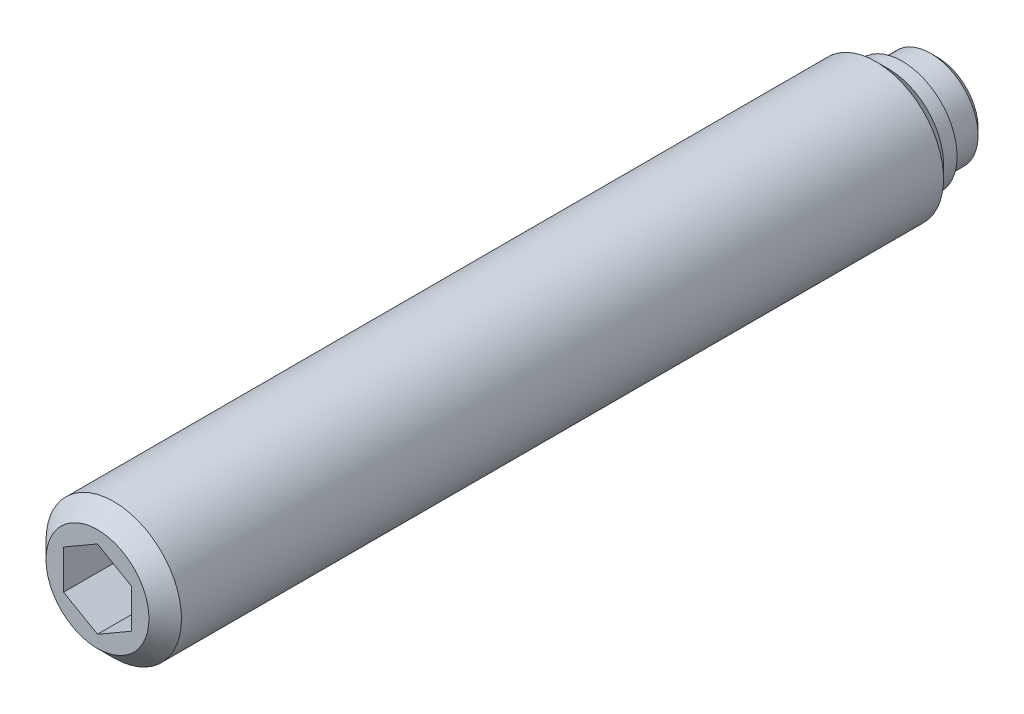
ISO-10303-21;
HEADER;
FILE_DESCRIPTION(('STEP AP214'),'2;1');
FILE_NAME('part.step','',(''),(''),'','','');
FILE_SCHEMA(('AUTOMOTIVE_DESIGN { 1 0 10303 214 1 1 1 1 }'));
ENDSEC;
DATA;
#1=APPLICATION_CONTEXT('core data for automotive mechanical design processes');
#2=APPLICATION_PROTOCOL_DEFINITION('international standard','automotive_design',2000,#1);
#3=PRODUCT_CONTEXT('',#1,'mechanical');
#4=PRODUCT('Part','Part','',(#3));
#5=PRODUCT_RELATED_PRODUCT_CATEGORY('part','',(#4));
#6=PRODUCT_DEFINITION_FORMATION('','',#4);
#7=PRODUCT_DEFINITION_CONTEXT('part definition',#1,'design');
#8=PRODUCT_DEFINITION('design','',#6,#7);
#9=PRODUCT_DEFINITION_SHAPE('','',#8);
#10=(LENGTH_UNIT() NAMED_UNIT(*) SI_UNIT(.MILLI.,.METRE.));
#11=(NAMED_UNIT(*) PLANE_ANGLE_UNIT() SI_UNIT($,.RADIAN.));
#12=(NAMED_UNIT(*) SI_UNIT($,.STERADIAN.) SOLID_ANGLE_UNIT());
#13=UNCERTAINTY_MEASURE_WITH_UNIT(LENGTH_MEASURE(1.E-05),#10,'distance_accuracy_value','');
#14=(GEOMETRIC_REPRESENTATION_CONTEXT(3) GLOBAL_UNCERTAINTY_ASSIGNED_CONTEXT((#13)) GLOBAL_UNIT_ASSIGNED_CONTEXT((#10,
#11,#12)) REPRESENTATION_CONTEXT('',''));
#15=CARTESIAN_POINT('',(0.,0.,0.));
#16=DIRECTION('',(0.,0.,1.));
#17=DIRECTION('',(1.,0.,0.));
#18=AXIS2_PLACEMENT_3D('',#15,#16,#17);
#19=CARTESIAN_POINT('',(0.,0.,2.6));
#20=DIRECTION('',(0.,0.,-1.));
#21=DIRECTION('',(-1.,0.,0.));
#22=AXIS2_PLACEMENT_3D('',#19,#20,#21);
#23=CYLINDRICAL_SURFACE('',#22,5.);
#24=CARTESIAN_POINT('',(0.,0.,4.55));
#25=DIRECTION('',(0.,0.,-1.));
#26=DIRECTION('',(-1.,0.,0.));
#27=AXIS2_PLACEMENT_3D('',#24,#25,#26);
#28=CIRCLE('',#27,5.);
#29=CARTESIAN_POINT('',(-5.,0.,4.55));
#30=VERTEX_POINT('',#29);
#31=EDGE_CURVE('E9',#30,#30,#28,.T.);
#32=ORIENTED_EDGE('',*,*,#31,.F.);
#33=EDGE_LOOP('',(#32));
#34=FACE_BOUND('',#33,.T.);
#35=CARTESIAN_POINT('',(0.,0.,60.8));
#36=DIRECTION('',(0.,0.,1.));
#37=DIRECTION('',(1.,0.,0.));
#38=AXIS2_PLACEMENT_3D('',#35,#36,#37);
#39=CIRCLE('',#38,5.);
#40=CARTESIAN_POINT('',(5.,0.,60.8));
#41=VERTEX_POINT('',#40);
#42=EDGE_CURVE('E123',#41,#41,#39,.T.);
#43=ORIENTED_EDGE('',*,*,#42,.F.);
#44=EDGE_LOOP('',(#43));
#45=FACE_BOUND('',#44,.T.);
#46=ADVANCED_FACE('F14',(#34,#45),#23,.T.);
#47=CARTESIAN_POINT('',(0.,0.,4.55));
#48=DIRECTION('',(0.,0.,1.));
#49=DIRECTION('',(1.,0.,0.));
#50=AXIS2_PLACEMENT_3D('',#47,#48,#49);
#51=CONICAL_SURFACE('',#50,5.,0.785398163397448);
#52=ORIENTED_EDGE('',*,*,#31,.T.);
#53=EDGE_LOOP('',(#52));
#54=FACE_BOUND('',#53,.T.);
#55=CARTESIAN_POINT('',(0.,0.,3.6));
#56=DIRECTION('',(0.,0.,-1.));
#57=DIRECTION('',(-1.,0.,0.));
#58=AXIS2_PLACEMENT_3D('',#55,#56,#57);
#59=CIRCLE('',#58,4.05);
#60=CARTESIAN_POINT('',(-4.05,0.,3.6));
#61=VERTEX_POINT('',#60);
#62=EDGE_CURVE('E21',#61,#61,#59,.T.);
#63=ORIENTED_EDGE('',*,*,#62,.F.);
#64=EDGE_LOOP('',(#63));
#65=FACE_BOUND('',#64,.T.);
#66=ADVANCED_FACE('F143',(#54,#65),#51,.T.);
#67=CARTESIAN_POINT('',(0.,0.,2.6));
#68=DIRECTION('',(0.,0.,-1.));
#69=DIRECTION('',(-1.,0.,0.));
#70=AXIS2_PLACEMENT_3D('',#67,#68,#69);
#71=CYLINDRICAL_SURFACE('',#70,4.05);
#72=ORIENTED_EDGE('',*,*,#62,.T.);
#73=EDGE_LOOP('',(#72));
#74=FACE_BOUND('',#73,.T.);
#75=CARTESIAN_POINT('',(0.,0.,2.6));
#76=DIRECTION('',(0.,0.,-1.));
#77=DIRECTION('',(-1.,0.,0.));
#78=AXIS2_PLACEMENT_3D('',#75,#76,#77);
#79=CIRCLE('',#78,4.05);
#80=CARTESIAN_POINT('',(-4.05,0.,2.6));
#81=VERTEX_POINT('',#80);
#82=EDGE_CURVE('E135',#81,#81,#79,.T.);
#83=ORIENTED_EDGE('',*,*,#82,.F.);
#84=EDGE_LOOP('',(#83));
#85=FACE_BOUND('',#84,.T.);
#86=ADVANCED_FACE('F140',(#74,#85),#71,.T.);
#87=CARTESIAN_POINT('',(0.,4.05,2.6));
#88=DIRECTION('',(0.,0.,1.));
#89=DIRECTION('',(1.,0.,0.));
#90=AXIS2_PLACEMENT_3D('',#87,#88,#89);
#91=PLANE('',#90);
#92=ORIENTED_EDGE('',*,*,#82,.T.);
#93=EDGE_LOOP('',(#92));
#94=FACE_BOUND('',#93,.T.);
#95=CARTESIAN_POINT('',(0.,0.,2.6));
#96=DIRECTION('',(0.,0.,-1.));
#97=DIRECTION('',(-1.,0.,0.));
#98=AXIS2_PLACEMENT_3D('',#95,#96,#97);
#99=CIRCLE('',#98,3.5);
#100=CARTESIAN_POINT('',(-3.5,0.,2.6));
#101=VERTEX_POINT('',#100);
#102=EDGE_CURVE('E132',#101,#101,#99,.T.);
#103=ORIENTED_EDGE('',*,*,#102,.F.);
#104=EDGE_LOOP('',(#103));
#105=FACE_BOUND('',#104,.T.);
#106=ADVANCED_FACE('F151',(#94,#105),#91,.F.);
#107=CARTESIAN_POINT('',(0.,0.,0.));
#108=DIRECTION('',(0.,0.,-1.));
#109=DIRECTION('',(-1.,0.,0.));
#110=AXIS2_PLACEMENT_3D('',#107,#108,#109);
#111=CYLINDRICAL_SURFACE('',#110,3.5);
#112=CARTESIAN_POINT('',(0.,0.,0.5));
#113=DIRECTION('',(0.,0.,-1.));
#114=DIRECTION('',(-1.,0.,0.));
#115=AXIS2_PLACEMENT_3D('',#112,#113,#114);
#116=CIRCLE('',#115,3.5);
#117=CARTESIAN_POINT('',(-3.5,0.,0.5));
#118=VERTEX_POINT('',#117);
#119=EDGE_CURVE('E129',#118,#118,#116,.T.);
#120=ORIENTED_EDGE('',*,*,#119,.F.);
#121=EDGE_LOOP('',(#120));
#122=FACE_BOUND('',#121,.T.);
#123=ORIENTED_EDGE('',*,*,#102,.T.);
#124=EDGE_LOOP('',(#123));
#125=FACE_BOUND('',#124,.T.);
#126=ADVANCED_FACE('F157',(#122,#125),#111,.T.);
#127=CARTESIAN_POINT('',(0.,0.,0.5));
#128=DIRECTION('',(0.,0.,1.));
#129=DIRECTION('',(1.,0.,0.));
#130=AXIS2_PLACEMENT_3D('',#127,#128,#129);
#131=CONICAL_SURFACE('',#130,3.5,0.785398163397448);
#132=CARTESIAN_POINT('',(0.,0.,0.));
#133=DIRECTION('',(0.,0.,-1.));
#134=DIRECTION('',(-1.,0.,0.));
#135=AXIS2_PLACEMENT_3D('',#132,#133,#134);
#136=CIRCLE('',#135,3.);
#137=CARTESIAN_POINT('',(-3.,0.,0.));
#138=VERTEX_POINT('',#137);
#139=EDGE_CURVE('E126',#138,#138,#136,.T.);
#140=ORIENTED_EDGE('',*,*,#139,.F.);
#141=EDGE_LOOP('',(#140));
#142=FACE_BOUND('',#141,.T.);
#143=ORIENTED_EDGE('',*,*,#119,.T.);
#144=EDGE_LOOP('',(#143));
#145=FACE_BOUND('',#144,.T.);
#146=ADVANCED_FACE('F161',(#142,#145),#131,.T.);
#147=CARTESIAN_POINT('',(0.,3.,0.));
#148=DIRECTION('',(0.,0.,1.));
#149=DIRECTION('',(1.,0.,0.));
#150=AXIS2_PLACEMENT_3D('',#147,#148,#149);
#151=PLANE('',#150);
#152=ORIENTED_EDGE('',*,*,#139,.T.);
#153=EDGE_LOOP('',(#152));
#154=FACE_BOUND('',#153,.T.);
#155=ADVANCED_FACE('F165',(#154),#151,.F.);
#156=CARTESIAN_POINT('',(0.,0.,62.));
#157=DIRECTION('',(0.,0.,-1.));
#158=DIRECTION('',(-1.,0.,0.));
#159=AXIS2_PLACEMENT_3D('',#156,#157,#158);
#160=CONICAL_SURFACE('',#159,3.8,0.785398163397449);
#161=ORIENTED_EDGE('',*,*,#42,.T.);
#162=EDGE_LOOP('',(#161));
#163=FACE_BOUND('',#162,.T.);
#164=CARTESIAN_POINT('',(0.,0.,62.));
#165=DIRECTION('',(0.,0.,1.));
#166=DIRECTION('',(1.,0.,0.));
#167=AXIS2_PLACEMENT_3D('',#164,#165,#166);
#168=CIRCLE('',#167,3.8);
#169=CARTESIAN_POINT('',(3.8,0.,62.));
#170=VERTEX_POINT('',#169);
#171=EDGE_CURVE('E115',#170,#170,#168,.T.);
#172=ORIENTED_EDGE('',*,*,#171,.F.);
#173=EDGE_LOOP('',(#172));
#174=FACE_BOUND('',#173,.T.);
#175=ADVANCED_FACE('F169',(#163,#174),#160,.T.);
#176=CARTESIAN_POINT('',(0.,-3.8,62.));
#177=DIRECTION('',(0.,0.,1.));
#178=DIRECTION('',(1.,0.,0.));
#179=AXIS2_PLACEMENT_3D('',#176,#177,#178);
#180=PLANE('',#179);
#181=DIRECTION('',(0.866025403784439,-0.5,0.));
#182=VECTOR('',#181,1.);
#183=CARTESIAN_POINT('',(-2.5,-1.44337567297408,62.));
#184=LINE('',#183,#182);
#185=CARTESIAN_POINT('',(-2.5,-1.44337567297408,62.));
#186=VERTEX_POINT('',#185);
#187=CARTESIAN_POINT('',(0.,-2.88675134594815,62.));
#188=VERTEX_POINT('',#187);
#189=EDGE_CURVE('E28',#186,#188,#184,.T.);
#190=ORIENTED_EDGE('',*,*,#189,.F.);
#191=DIRECTION('',(0.,-1.,0.));
#192=VECTOR('',#191,1.);
#193=CARTESIAN_POINT('',(-2.5,1.44337567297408,62.));
#194=LINE('',#193,#192);
#195=CARTESIAN_POINT('',(-2.5,1.44337567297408,62.));
#196=VERTEX_POINT('',#195);
#197=EDGE_CURVE('E111',#196,#186,#194,.T.);
#198=ORIENTED_EDGE('',*,*,#197,.F.);
#199=DIRECTION('',(-0.866025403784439,-0.5,0.));
#200=VECTOR('',#199,1.);
#201=CARTESIAN_POINT('',(0.,2.88675134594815,62.));
#202=LINE('',#201,#200);
#203=CARTESIAN_POINT('',(0.,2.88675134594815,62.));
#204=VERTEX_POINT('',#203);
#205=EDGE_CURVE('E109',#204,#196,#202,.T.);
#206=ORIENTED_EDGE('',*,*,#205,.F.);
#207=DIRECTION('',(-0.866025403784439,0.5,0.));
#208=VECTOR('',#207,1.);
#209=CARTESIAN_POINT('',(2.5,1.44337567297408,62.));
#210=LINE('',#209,#208);
#211=CARTESIAN_POINT('',(2.5,1.44337567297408,62.));
#212=VERTEX_POINT('',#211);
#213=EDGE_CURVE('E76',#212,#204,#210,.T.);
#214=ORIENTED_EDGE('',*,*,#213,.F.);
#215=DIRECTION('',(0.,1.,0.));
#216=VECTOR('',#215,1.);
#217=CARTESIAN_POINT('',(2.5,-1.44337567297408,62.));
#218=LINE('',#217,#216);
#219=CARTESIAN_POINT('',(2.5,-1.44337567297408,62.));
#220=VERTEX_POINT('',#219);
#221=EDGE_CURVE('E105',#220,#212,#218,.T.);
#222=ORIENTED_EDGE('',*,*,#221,.F.);
#223=DIRECTION('',(0.866025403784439,0.5,0.));
#224=VECTOR('',#223,1.);
#225=CARTESIAN_POINT('',(0.,-2.88675134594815,62.));
#226=LINE('',#225,#224);
#227=EDGE_CURVE('E102',#188,#220,#226,.T.);
#228=ORIENTED_EDGE('',*,*,#227,.F.);
#229=EDGE_LOOP('',(#190,#198,#206,#214,#222,#228));
#230=FACE_BOUND('',#229,.T.);
#231=ORIENTED_EDGE('',*,*,#171,.T.);
#232=EDGE_LOOP('',(#231));
#233=FACE_BOUND('',#232,.T.);
#234=ADVANCED_FACE('F173',(#230,#233),#180,.T.);
#235=CARTESIAN_POINT('',(-2.5,-1.44337567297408,56.));
#236=DIRECTION('',(-0.5,-0.866025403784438,0.));
#237=DIRECTION('',(0.866025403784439,-0.5,0.));
#238=AXIS2_PLACEMENT_3D('',#235,#236,#237);
#239=PLANE('',#238);
#240=ORIENTED_EDGE('',*,*,#189,.T.);
#241=DIRECTION('',(0.,0.,1.));
#242=VECTOR('',#241,1.);
#243=CARTESIAN_POINT('',(0.,-2.88675134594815,56.));
#244=LINE('',#243,#242);
#245=CARTESIAN_POINT('',(0.,-2.88675134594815,56.));
#246=VERTEX_POINT('',#245);
#247=EDGE_CURVE('E58',#246,#188,#244,.T.);
#248=ORIENTED_EDGE('',*,*,#247,.F.);
#249=DIRECTION('',(0.866025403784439,-0.5,0.));
#250=VECTOR('',#249,1.);
#251=CARTESIAN_POINT('',(-2.5,-1.44337567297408,56.));
#252=LINE('',#251,#250);
#253=CARTESIAN_POINT('',(-2.5,-1.44337567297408,56.));
#254=VERTEX_POINT('',#253);
#255=EDGE_CURVE('E113',#254,#246,#252,.T.);
#256=ORIENTED_EDGE('',*,*,#255,.F.);
#257=DIRECTION('',(0.,0.,1.));
#258=VECTOR('',#257,1.);
#259=CARTESIAN_POINT('',(-2.5,-1.44337567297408,56.));
#260=LINE('',#259,#258);
#261=EDGE_CURVE('E36',#254,#186,#260,.T.);
#262=ORIENTED_EDGE('',*,*,#261,.T.);
#263=EDGE_LOOP('',(#240,#248,#256,#262));
#264=FACE_BOUND('',#263,.T.);
#265=ADVANCED_FACE('F177',(#264),#239,.F.);
#266=CARTESIAN_POINT('',(-2.5,1.44337567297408,56.));
#267=DIRECTION('',(-1.,0.,0.));
#268=DIRECTION('',(0.,0.,1.));
#269=AXIS2_PLACEMENT_3D('',#266,#267,#268);
#270=PLANE('',#269);
#271=ORIENTED_EDGE('',*,*,#197,.T.);
#272=ORIENTED_EDGE('',*,*,#261,.F.);
#273=DIRECTION('',(0.,-1.,0.));
#274=VECTOR('',#273,1.);
#275=CARTESIAN_POINT('',(-2.5,1.44337567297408,56.));
#276=LINE('',#275,#274);
#277=CARTESIAN_POINT('',(-2.5,1.44337567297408,56.));
#278=VERTEX_POINT('',#277);
#279=EDGE_CURVE('E88',#278,#254,#276,.T.);
#280=ORIENTED_EDGE('',*,*,#279,.F.);
#281=DIRECTION('',(0.,0.,1.));
#282=VECTOR('',#281,1.);
#283=CARTESIAN_POINT('',(-2.5,1.44337567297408,56.));
#284=LINE('',#283,#282);
#285=EDGE_CURVE('E80',#278,#196,#284,.T.);
#286=ORIENTED_EDGE('',*,*,#285,.T.);
#287=EDGE_LOOP('',(#271,#272,#280,#286));
#288=FACE_BOUND('',#287,.T.);
#289=ADVANCED_FACE('F181',(#288),#270,.F.);
#290=CARTESIAN_POINT('',(0.,2.88675134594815,56.));
#291=DIRECTION('',(-0.5,0.866025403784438,0.));
#292=DIRECTION('',(-0.866025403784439,-0.5,0.));
#293=AXIS2_PLACEMENT_3D('',#290,#291,#292);
#294=PLANE('',#293);
#295=ORIENTED_EDGE('',*,*,#205,.T.);
#296=ORIENTED_EDGE('',*,*,#285,.F.);
#297=DIRECTION('',(-0.866025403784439,-0.5,0.));
#298=VECTOR('',#297,1.);
#299=CARTESIAN_POINT('',(0.,2.88675134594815,56.));
#300=LINE('',#299,#298);
#301=CARTESIAN_POINT('',(0.,2.88675134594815,56.));
#302=VERTEX_POINT('',#301);
#303=EDGE_CURVE('E84',#302,#278,#300,.T.);
#304=ORIENTED_EDGE('',*,*,#303,.F.);
#305=DIRECTION('',(0.,0.,1.));
#306=VECTOR('',#305,1.);
#307=CARTESIAN_POINT('',(0.,2.88675134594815,56.));
#308=LINE('',#307,#306);
#309=EDGE_CURVE('E69',#302,#204,#308,.T.);
#310=ORIENTED_EDGE('',*,*,#309,.T.);
#311=EDGE_LOOP('',(#295,#296,#304,#310));
#312=FACE_BOUND('',#311,.T.);
#313=ADVANCED_FACE('F85',(#312),#294,.F.);
#314=CARTESIAN_POINT('',(2.5,1.44337567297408,56.));
#315=DIRECTION('',(0.5,0.866025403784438,0.));
#316=DIRECTION('',(-0.866025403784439,0.5,0.));
#317=AXIS2_PLACEMENT_3D('',#314,#315,#316);
#318=PLANE('',#317);
#319=ORIENTED_EDGE('',*,*,#213,.T.);
#320=ORIENTED_EDGE('',*,*,#309,.F.);
#321=DIRECTION('',(-0.866025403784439,0.5,0.));
#322=VECTOR('',#321,1.);
#323=CARTESIAN_POINT('',(2.5,1.44337567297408,56.));
#324=LINE('',#323,#322);
#325=CARTESIAN_POINT('',(2.5,1.44337567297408,56.));
#326=VERTEX_POINT('',#325);
#327=EDGE_CURVE('E73',#326,#302,#324,.T.);
#328=ORIENTED_EDGE('',*,*,#327,.F.);
#329=DIRECTION('',(0.,0.,1.));
#330=VECTOR('',#329,1.);
#331=CARTESIAN_POINT('',(2.5,1.44337567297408,56.));
#332=LINE('',#331,#330);
#333=EDGE_CURVE('E81',#326,#212,#332,.T.);
#334=ORIENTED_EDGE('',*,*,#333,.T.);
#335=EDGE_LOOP('',(#319,#320,#328,#334));
#336=FACE_BOUND('',#335,.T.);
#337=ADVANCED_FACE('F71',(#336),#318,.F.);
#338=CARTESIAN_POINT('',(2.5,-1.44337567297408,56.));
#339=DIRECTION('',(1.,0.,0.));
#340=DIRECTION('',(0.,0.,-1.));
#341=AXIS2_PLACEMENT_3D('',#338,#339,#340);
#342=PLANE('',#341);
#343=ORIENTED_EDGE('',*,*,#221,.T.);
#344=ORIENTED_EDGE('',*,*,#333,.F.);
#345=DIRECTION('',(0.,1.,0.));
#346=VECTOR('',#345,1.);
#347=CARTESIAN_POINT('',(2.5,-1.44337567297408,56.));
#348=LINE('',#347,#346);
#349=CARTESIAN_POINT('',(2.5,-1.44337567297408,56.));
#350=VERTEX_POINT('',#349);
#351=EDGE_CURVE('E94',#350,#326,#348,.T.);
#352=ORIENTED_EDGE('',*,*,#351,.F.);
#353=DIRECTION('',(0.,0.,1.));
#354=VECTOR('',#353,1.);
#355=CARTESIAN_POINT('',(2.5,-1.44337567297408,56.));
#356=LINE('',#355,#354);
#357=EDGE_CURVE('E118',#350,#220,#356,.T.);
#358=ORIENTED_EDGE('',*,*,#357,.T.);
#359=EDGE_LOOP('',(#343,#344,#352,#358));
#360=FACE_BOUND('',#359,.T.);
#361=ADVANCED_FACE('F185',(#360),#342,.F.);
#362=CARTESIAN_POINT('',(0.,-2.88675134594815,56.));
#363=DIRECTION('',(0.5,-0.866025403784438,0.));
#364=DIRECTION('',(0.866025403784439,0.5,0.));
#365=AXIS2_PLACEMENT_3D('',#362,#363,#364);
#366=PLANE('',#365);
#367=ORIENTED_EDGE('',*,*,#227,.T.);
#368=ORIENTED_EDGE('',*,*,#357,.F.);
#369=DIRECTION('',(0.866025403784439,0.5,0.));
#370=VECTOR('',#369,1.);
#371=CARTESIAN_POINT('',(0.,-2.88675134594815,56.));
#372=LINE('',#371,#370);
#373=EDGE_CURVE('E96',#246,#350,#372,.T.);
#374=ORIENTED_EDGE('',*,*,#373,.F.);
#375=ORIENTED_EDGE('',*,*,#247,.T.);
#376=EDGE_LOOP('',(#367,#368,#374,#375));
#377=FACE_BOUND('',#376,.T.);
#378=ADVANCED_FACE('F182',(#377),#366,.F.);
#379=CARTESIAN_POINT('',(0.,0.,56.));
#380=DIRECTION('',(0.,0.,1.));
#381=DIRECTION('',(1.,0.,0.));
#382=AXIS2_PLACEMENT_3D('',#379,#380,#381);
#383=PLANE('',#382);
#384=ORIENTED_EDGE('',*,*,#255,.T.);
#385=ORIENTED_EDGE('',*,*,#373,.T.);
#386=ORIENTED_EDGE('',*,*,#351,.T.);
#387=ORIENTED_EDGE('',*,*,#327,.T.);
#388=ORIENTED_EDGE('',*,*,#303,.T.);
#389=ORIENTED_EDGE('',*,*,#279,.T.);
#390=EDGE_LOOP('',(#384,#385,#386,#387,#388,#389));
#391=FACE_BOUND('',#390,.T.);
#392=ADVANCED_FACE('F91',(#391),#383,.T.);
#393=CLOSED_SHELL('',(#46,#66,#86,#106,#126,#146,#155,#175,#234,#265,#289,#313,#337,#361,#378,#392));
#394=MANIFOLD_SOLID_BREP('B1',#393);
#395=ADVANCED_BREP_SHAPE_REPRESENTATION('',(#18,#394),#14);
#396=SHAPE_DEFINITION_REPRESENTATION(#9,#395);
ENDSEC;
END-ISO-10303-21;
